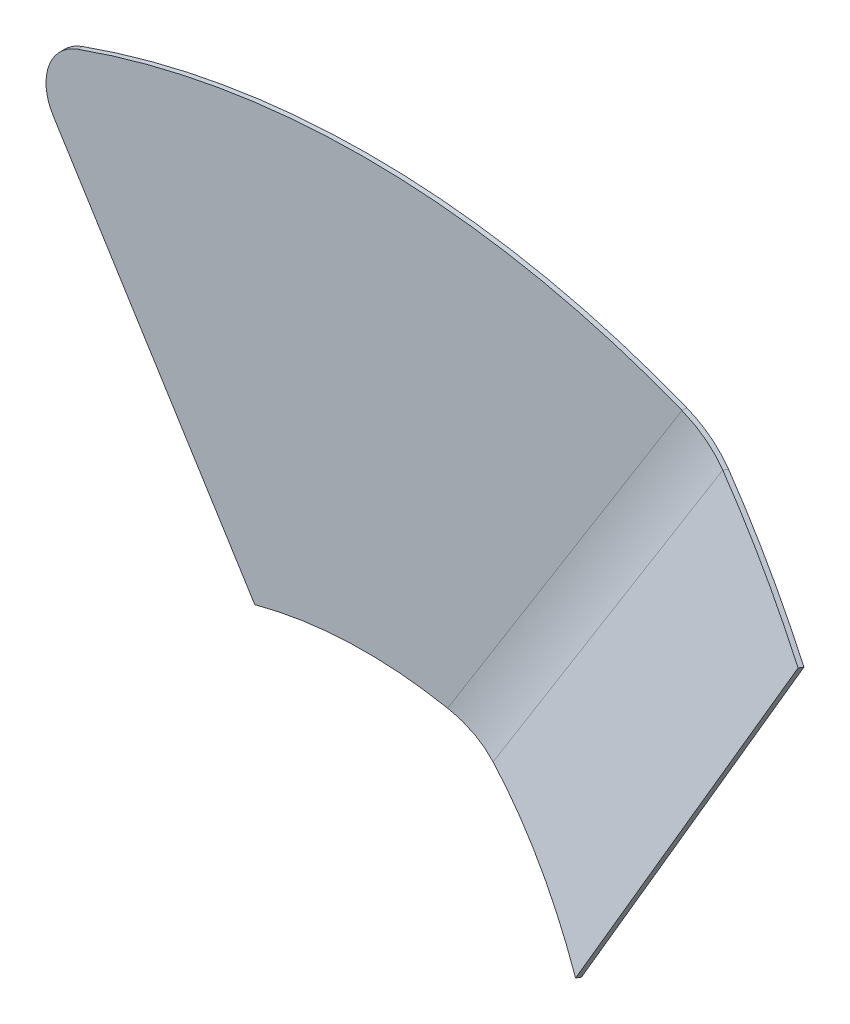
ISO-10303-21;
HEADER;
FILE_DESCRIPTION(('STEP AP214'),'2;1');
FILE_NAME('part.step','',(''),(''),'','','');
FILE_SCHEMA(('AUTOMOTIVE_DESIGN { 1 0 10303 214 1 1 1 1 }'));
ENDSEC;
DATA;
#1=APPLICATION_CONTEXT('core data for automotive mechanical design processes');
#2=APPLICATION_PROTOCOL_DEFINITION('international standard','automotive_design',2000,#1);
#3=PRODUCT_CONTEXT('',#1,'mechanical');
#4=PRODUCT('Part','Part','',(#3));
#5=PRODUCT_RELATED_PRODUCT_CATEGORY('part','',(#4));
#6=PRODUCT_DEFINITION_FORMATION('','',#4);
#7=PRODUCT_DEFINITION_CONTEXT('part definition',#1,'design');
#8=PRODUCT_DEFINITION('design','',#6,#7);
#9=PRODUCT_DEFINITION_SHAPE('','',#8);
#10=(LENGTH_UNIT() NAMED_UNIT(*) SI_UNIT(.MILLI.,.METRE.));
#11=(NAMED_UNIT(*) PLANE_ANGLE_UNIT() SI_UNIT($,.RADIAN.));
#12=(NAMED_UNIT(*) SI_UNIT($,.STERADIAN.) SOLID_ANGLE_UNIT());
#13=UNCERTAINTY_MEASURE_WITH_UNIT(LENGTH_MEASURE(1.E-05),#10,'distance_accuracy_value','');
#14=(GEOMETRIC_REPRESENTATION_CONTEXT(3) GLOBAL_UNCERTAINTY_ASSIGNED_CONTEXT((#13)) GLOBAL_UNIT_ASSIGNED_CONTEXT((#10,
#11,#12)) REPRESENTATION_CONTEXT('',''));
#15=CARTESIAN_POINT('',(0.,0.,0.));
#16=DIRECTION('',(0.,0.,1.));
#17=DIRECTION('',(1.,0.,0.));
#18=AXIS2_PLACEMENT_3D('',#15,#16,#17);
#19=CARTESIAN_POINT('',(-0.416680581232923,0.260370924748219,2.99307608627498));
#20=DIRECTION('',(-0.290049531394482,0.181243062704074,0.939692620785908));
#21=DIRECTION('',(0.956627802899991,0.027101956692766,0.290049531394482));
#22=AXIS2_PLACEMENT_3D('',#19,#20,#21);
#23=PLANE('',#22);
#24=CARTESIAN_POINT('',(-0.416680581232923,0.260370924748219,2.99307608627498));
#25=DIRECTION('',(-0.290049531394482,0.181243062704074,0.939692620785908));
#26=DIRECTION('',(0.956627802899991,0.027101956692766,0.290049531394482));
#27=AXIS2_PLACEMENT_3D('',#24,#25,#26);
#28=CIRCLE('',#27,54.);
#29=CARTESIAN_POINT('',(31.4014001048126,43.867948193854,4.40337611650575));
#30=VERTEX_POINT('',#29);
#31=CARTESIAN_POINT('',(23.1454572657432,48.8037283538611,0.903073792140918));
#32=VERTEX_POINT('',#31);
#33=EDGE_CURVE('E242',#30,#32,#28,.T.);
#34=ORIENTED_EDGE('',*,*,#33,.T.);
#35=DIRECTION('',(-0.529919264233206,-0.848048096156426,0.));
#36=VECTOR('',#35,1.);
#37=CARTESIAN_POINT('',(-5.28637128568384,3.30329139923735,0.903073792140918));
#38=LINE('',#37,#36);
#39=CARTESIAN_POINT('',(8.65018940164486,25.6064506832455,0.903073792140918));
#40=VERTEX_POINT('',#39);
#41=EDGE_CURVE('E38',#32,#40,#38,.T.);
#42=ORIENTED_EDGE('',*,*,#41,.T.);
#43=CARTESIAN_POINT('',(-0.416680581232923,0.260370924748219,2.99307608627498));
#44=DIRECTION('',(-0.290049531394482,0.181243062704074,0.939692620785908));
#45=DIRECTION('',(0.956627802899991,0.027101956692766,0.290049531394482));
#46=AXIS2_PLACEMENT_3D('',#43,#44,#45);
#47=CIRCLE('',#46,27.);
#48=CARTESIAN_POINT('',(17.6822308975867,20.2206679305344,4.72972421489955));
#49=VERTEX_POINT('',#48);
#50=EDGE_CURVE('E216',#49,#40,#47,.T.);
#51=ORIENTED_EDGE('',*,*,#50,.F.);
#52=DIRECTION('',(0.501784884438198,0.864910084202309,-0.0119363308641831));
#53=VECTOR('',#52,1.);
#54=CARTESIAN_POINT('',(17.6822308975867,20.2206679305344,4.72972421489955));
#55=LINE('',#54,#53);
#56=EDGE_CURVE('E246',#49,#30,#55,.T.);
#57=ORIENTED_EDGE('',*,*,#56,.T.);
#58=EDGE_LOOP('',(#34,#42,#51,#57));
#59=FACE_BOUND('',#58,.T.);
#60=ADVANCED_FACE('F28',(#59),#23,.T.);
#61=CARTESIAN_POINT('',(-0.416680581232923,0.260370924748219,2.99307608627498));
#62=DIRECTION('',(0.290049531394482,-0.181243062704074,-0.939692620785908));
#63=DIRECTION('',(-0.956627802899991,-0.027101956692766,-0.290049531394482));
#64=AXIS2_PLACEMENT_3D('',#61,#62,#63);
#65=CYLINDRICAL_SURFACE('',#64,27.);
#66=ORIENTED_EDGE('',*,*,#50,.T.);
#67=CARTESIAN_POINT('',(8.7372042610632,25.5520777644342,0.621166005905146));
#68=CARTESIAN_POINT('',(8.65018940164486,25.6064506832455,0.903073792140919));
#69=B_SPLINE_CURVE_WITH_KNOTS('',1,(#67,#68),.UNSPECIFIED.,.F.,.F.,(2,2),(0.,1.),.UNSPECIFIED.);
#70=CARTESIAN_POINT('',(8.73720426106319,25.5520777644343,0.621166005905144));
#71=VERTEX_POINT('',#70);
#72=EDGE_CURVE('E228',#40,#71,#69,.F.);
#73=ORIENTED_EDGE('',*,*,#72,.T.);
#74=CARTESIAN_POINT('',(-0.329665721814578,0.205998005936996,2.71116830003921));
#75=DIRECTION('',(-0.290049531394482,0.181243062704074,0.939692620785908));
#76=DIRECTION('',(0.956627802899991,0.027101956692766,0.290049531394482));
#77=AXIS2_PLACEMENT_3D('',#74,#75,#76);
#78=CIRCLE('',#77,27.);
#79=CARTESIAN_POINT('',(17.769245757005,20.1662950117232,4.44781642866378));
#80=VERTEX_POINT('',#79);
#81=EDGE_CURVE('E140',#80,#71,#78,.T.);
#82=ORIENTED_EDGE('',*,*,#81,.F.);
#83=DIRECTION('',(0.290049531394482,-0.181243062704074,-0.939692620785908));
#84=VECTOR('',#83,1.);
#85=CARTESIAN_POINT('',(17.6822308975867,20.2206679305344,4.72972421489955));
#86=LINE('',#85,#84);
#87=EDGE_CURVE('E52',#49,#80,#86,.T.);
#88=ORIENTED_EDGE('',*,*,#87,.F.);
#89=EDGE_LOOP('',(#66,#73,#82,#88));
#90=FACE_BOUND('',#89,.T.);
#91=ADVANCED_FACE('F30',(#90),#65,.F.);
#92=CARTESIAN_POINT('',(17.6822308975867,20.2206679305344,4.72972421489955));
#93=DIRECTION('',(-0.814913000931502,0.468061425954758,-0.34181179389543));
#94=DIRECTION('',(-0.501784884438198,-0.864910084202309,0.0119363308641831));
#95=AXIS2_PLACEMENT_3D('',#92,#93,#94);
#96=PLANE('',#95);
#97=DIRECTION('',(0.501784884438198,0.864910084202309,-0.0119363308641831));
#98=VECTOR('',#97,1.);
#99=CARTESIAN_POINT('',(17.769245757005,20.1662950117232,4.44781642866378));
#100=LINE('',#99,#98);
#101=CARTESIAN_POINT('',(31.4884149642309,43.8135752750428,4.12146833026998));
#102=VERTEX_POINT('',#101);
#103=EDGE_CURVE('E213',#80,#102,#100,.T.);
#104=ORIENTED_EDGE('',*,*,#103,.T.);
#105=DIRECTION('',(0.290049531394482,-0.181243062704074,-0.939692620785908));
#106=VECTOR('',#105,1.);
#107=CARTESIAN_POINT('',(31.4014001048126,43.867948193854,4.40337611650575));
#108=LINE('',#107,#106);
#109=EDGE_CURVE('E249',#30,#102,#108,.T.);
#110=ORIENTED_EDGE('',*,*,#109,.F.);
#111=ORIENTED_EDGE('',*,*,#56,.F.);
#112=ORIENTED_EDGE('',*,*,#87,.T.);
#113=EDGE_LOOP('',(#104,#110,#111,#112));
#114=FACE_BOUND('',#113,.T.);
#115=ADVANCED_FACE('F195',(#114),#96,.F.);
#116=CARTESIAN_POINT('',(-0.416680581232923,0.260370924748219,2.99307608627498));
#117=DIRECTION('',(0.290049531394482,-0.181243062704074,-0.939692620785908));
#118=DIRECTION('',(-0.956627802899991,-0.027101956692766,-0.290049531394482));
#119=AXIS2_PLACEMENT_3D('',#116,#117,#118);
#120=CYLINDRICAL_SURFACE('',#119,54.);
#121=CARTESIAN_POINT('',(23.1454572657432,48.8037283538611,0.903073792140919));
#122=CARTESIAN_POINT('',(23.2324721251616,48.7493554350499,0.621166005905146));
#123=B_SPLINE_CURVE_WITH_KNOTS('',1,(#121,#122),.UNSPECIFIED.,.F.,.F.,(2,2),(0.,1.),.UNSPECIFIED.);
#124=CARTESIAN_POINT('',(23.2324721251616,48.7493554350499,0.621166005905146));
#125=VERTEX_POINT('',#124);
#126=EDGE_CURVE('E238',#32,#125,#123,.T.);
#127=ORIENTED_EDGE('',*,*,#126,.F.);
#128=ORIENTED_EDGE('',*,*,#33,.F.);
#129=ORIENTED_EDGE('',*,*,#109,.T.);
#130=CARTESIAN_POINT('',(-0.329665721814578,0.205998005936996,2.71116830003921));
#131=DIRECTION('',(-0.290049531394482,0.181243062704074,0.939692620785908));
#132=DIRECTION('',(0.956627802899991,0.027101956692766,0.290049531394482));
#133=AXIS2_PLACEMENT_3D('',#130,#131,#132);
#134=CIRCLE('',#133,54.);
#135=EDGE_CURVE('E206',#102,#125,#134,.T.);
#136=ORIENTED_EDGE('',*,*,#135,.T.);
#137=EDGE_LOOP('',(#127,#128,#129,#136));
#138=FACE_BOUND('',#137,.T.);
#139=ADVANCED_FACE('F190',(#138),#120,.T.);
#140=CARTESIAN_POINT('',(-0.329665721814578,0.205998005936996,2.71116830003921));
#141=DIRECTION('',(-0.290049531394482,0.181243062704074,0.939692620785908));
#142=DIRECTION('',(0.956627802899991,0.027101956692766,0.290049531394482));
#143=AXIS2_PLACEMENT_3D('',#140,#141,#142);
#144=PLANE('',#143);
#145=DIRECTION('',(-0.529919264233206,-0.848048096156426,0.));
#146=VECTOR('',#145,1.);
#147=CARTESIAN_POINT('',(-5.1993564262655,3.24891848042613,0.621166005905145));
#148=LINE('',#147,#146);
#149=EDGE_CURVE('E11',#125,#71,#148,.T.);
#150=ORIENTED_EDGE('',*,*,#149,.F.);
#151=ORIENTED_EDGE('',*,*,#135,.F.);
#152=ORIENTED_EDGE('',*,*,#103,.F.);
#153=ORIENTED_EDGE('',*,*,#81,.T.);
#154=EDGE_LOOP('',(#150,#151,#152,#153));
#155=FACE_BOUND('',#154,.T.);
#156=ADVANCED_FACE('F187',(#155),#144,.F.);
#157=CARTESIAN_POINT('',(0.,0.,0.3));
#158=DIRECTION('',(0.,0.,-1.));
#159=DIRECTION('',(-1.,0.,0.));
#160=AXIS2_PLACEMENT_3D('',#157,#158,#159);
#161=CYLINDRICAL_SURFACE('',#160,54.);
#162=CARTESIAN_POINT('',(0.,0.,0.3));
#163=DIRECTION('',(0.,0.,1.));
#164=DIRECTION('',(1.,0.,0.));
#165=AXIS2_PLACEMENT_3D('',#162,#163,#164);
#166=CIRCLE('',#165,54.);
#167=CARTESIAN_POINT('',(19.9677823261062,50.17257885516,0.3));
#168=VERTEX_POINT('',#167);
#169=CARTESIAN_POINT('',(-18.1850655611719,50.8458787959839,0.3));
#170=VERTEX_POINT('',#169);
#171=EDGE_CURVE('E136',#168,#170,#166,.T.);
#172=ORIENTED_EDGE('',*,*,#171,.F.);
#173=CARTESIAN_POINT('',(19.9677823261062,50.1725788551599,0.));
#174=CARTESIAN_POINT('',(19.9677823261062,50.1725788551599,0.3));
#175=B_SPLINE_CURVE_WITH_KNOTS('',1,(#173,#174),.UNSPECIFIED.,.F.,.F.,(2,2),(0.,1.),.UNSPECIFIED.);
#176=CARTESIAN_POINT('',(19.9677823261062,50.1725788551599,0.));
#177=VERTEX_POINT('',#176);
#178=EDGE_CURVE('E102',#168,#177,#175,.F.);
#179=ORIENTED_EDGE('',*,*,#178,.T.);
#180=CARTESIAN_POINT('',(0.,0.,0.));
#181=DIRECTION('',(0.,0.,1.));
#182=DIRECTION('',(1.,0.,0.));
#183=AXIS2_PLACEMENT_3D('',#180,#181,#182);
#184=CIRCLE('',#183,54.);
#185=CARTESIAN_POINT('',(-18.1850655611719,50.8458787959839,0.));
#186=VERTEX_POINT('',#185);
#187=EDGE_CURVE('E160',#177,#186,#184,.T.);
#188=ORIENTED_EDGE('',*,*,#187,.T.);
#189=DIRECTION('',(0.,0.,-1.));
#190=VECTOR('',#189,1.);
#191=CARTESIAN_POINT('',(-18.1850655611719,50.8458787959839,0.3));
#192=LINE('',#191,#190);
#193=EDGE_CURVE('E144',#170,#186,#192,.T.);
#194=ORIENTED_EDGE('',*,*,#193,.F.);
#195=EDGE_LOOP('',(#172,#179,#188,#194));
#196=FACE_BOUND('',#195,.T.);
#197=ADVANCED_FACE('F142',(#196),#161,.T.);
#198=CARTESIAN_POINT('',(0.,0.,0.));
#199=DIRECTION('',(0.,0.,1.));
#200=DIRECTION('',(1.,0.,0.));
#201=AXIS2_PLACEMENT_3D('',#198,#199,#200);
#202=PLANE('',#201);
#203=ORIENTED_EDGE('',*,*,#187,.F.);
#204=DIRECTION('',(-0.529919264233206,-0.848048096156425,0.));
#205=VECTOR('',#204,1.);
#206=CARTESIAN_POINT('',(-8.18686659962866,5.1157220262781,0.));
#207=LINE('',#206,#205);
#208=CARTESIAN_POINT('',(5.17513568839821,26.499395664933,0.));
#209=VERTEX_POINT('',#208);
#210=EDGE_CURVE('E117',#177,#209,#207,.T.);
#211=ORIENTED_EDGE('',*,*,#210,.T.);
#212=CARTESIAN_POINT('',(0.,0.,0.));
#213=DIRECTION('',(0.,0.,1.));
#214=DIRECTION('',(1.,0.,0.));
#215=AXIS2_PLACEMENT_3D('',#212,#213,#214);
#216=CIRCLE('',#215,27.);
#217=CARTESIAN_POINT('',(-7.,26.0768096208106,0.));
#218=VERTEX_POINT('',#217);
#219=EDGE_CURVE('E171',#209,#218,#216,.T.);
#220=ORIENTED_EDGE('',*,*,#219,.T.);
#221=DIRECTION('',(-0.529919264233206,0.848048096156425,0.));
#222=VECTOR('',#221,1.);
#223=CARTESIAN_POINT('',(-7.,26.0768096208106,0.));
#224=LINE('',#223,#222);
#225=CARTESIAN_POINT('',(-19.718928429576,46.4313499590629,0.));
#226=VERTEX_POINT('',#225);
#227=EDGE_CURVE('E438',#218,#226,#224,.T.);
#228=ORIENTED_EDGE('',*,*,#227,.T.);
#229=CARTESIAN_POINT('',(-17.1747841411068,48.0211077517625,0.));
#230=DIRECTION('',(0.,0.,-1.));
#231=DIRECTION('',(-1.,0.,0.));
#232=AXIS2_PLACEMENT_3D('',#229,#230,#231);
#233=CIRCLE('',#232,3.00000000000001);
#234=EDGE_CURVE('E439',#226,#186,#233,.T.);
#235=ORIENTED_EDGE('',*,*,#234,.T.);
#236=EDGE_LOOP('',(#203,#211,#220,#228,#235));
#237=FACE_BOUND('',#236,.T.);
#238=ADVANCED_FACE('F184',(#237),#202,.F.);
#239=CARTESIAN_POINT('',(0.,0.,0.3));
#240=DIRECTION('',(0.,0.,-1.));
#241=DIRECTION('',(-1.,0.,0.));
#242=AXIS2_PLACEMENT_3D('',#239,#240,#241);
#243=CYLINDRICAL_SURFACE('',#242,27.);
#244=CARTESIAN_POINT('',(5.17513568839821,26.499395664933,0.3));
#245=CARTESIAN_POINT('',(5.17513568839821,26.499395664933,0.));
#246=B_SPLINE_CURVE_WITH_KNOTS('',1,(#244,#245),.UNSPECIFIED.,.F.,.F.,(2,2),(0.,1.),.UNSPECIFIED.);
#247=CARTESIAN_POINT('',(5.17513568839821,26.499395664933,0.3));
#248=VERTEX_POINT('',#247);
#249=EDGE_CURVE('E116',#248,#209,#246,.T.);
#250=ORIENTED_EDGE('',*,*,#249,.F.);
#251=CARTESIAN_POINT('',(0.,0.,0.3));
#252=DIRECTION('',(0.,0.,1.));
#253=DIRECTION('',(1.,0.,0.));
#254=AXIS2_PLACEMENT_3D('',#251,#252,#253);
#255=CIRCLE('',#254,27.);
#256=CARTESIAN_POINT('',(-7.,26.0768096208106,0.3));
#257=VERTEX_POINT('',#256);
#258=EDGE_CURVE('E139',#248,#257,#255,.T.);
#259=ORIENTED_EDGE('',*,*,#258,.T.);
#260=DIRECTION('',(0.,0.,-1.));
#261=VECTOR('',#260,1.);
#262=CARTESIAN_POINT('',(-7.,26.0768096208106,0.3));
#263=LINE('',#262,#261);
#264=EDGE_CURVE('E146',#257,#218,#263,.T.);
#265=ORIENTED_EDGE('',*,*,#264,.T.);
#266=ORIENTED_EDGE('',*,*,#219,.F.);
#267=EDGE_LOOP('',(#250,#259,#265,#266));
#268=FACE_BOUND('',#267,.T.);
#269=ADVANCED_FACE('F173',(#268),#243,.F.);
#270=CARTESIAN_POINT('',(-17.1747841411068,48.0211077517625,0.3));
#271=DIRECTION('',(0.,0.,-1.));
#272=DIRECTION('',(-1.,0.,0.));
#273=AXIS2_PLACEMENT_3D('',#270,#271,#272);
#274=CYLINDRICAL_SURFACE('',#273,3.00000000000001);
#275=ORIENTED_EDGE('',*,*,#234,.F.);
#276=DIRECTION('',(0.,0.,-1.));
#277=VECTOR('',#276,1.);
#278=CARTESIAN_POINT('',(-19.718928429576,46.4313499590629,0.3));
#279=LINE('',#278,#277);
#280=CARTESIAN_POINT('',(-19.718928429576,46.4313499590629,0.3));
#281=VERTEX_POINT('',#280);
#282=EDGE_CURVE('E150',#281,#226,#279,.T.);
#283=ORIENTED_EDGE('',*,*,#282,.F.);
#284=CARTESIAN_POINT('',(-17.1747841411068,48.0211077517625,0.3));
#285=DIRECTION('',(0.,0.,-1.));
#286=DIRECTION('',(-1.,0.,0.));
#287=AXIS2_PLACEMENT_3D('',#284,#285,#286);
#288=CIRCLE('',#287,3.00000000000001);
#289=EDGE_CURVE('E147',#281,#170,#288,.T.);
#290=ORIENTED_EDGE('',*,*,#289,.T.);
#291=ORIENTED_EDGE('',*,*,#193,.T.);
#292=EDGE_LOOP('',(#275,#283,#290,#291));
#293=FACE_BOUND('',#292,.T.);
#294=ADVANCED_FACE('F183',(#293),#274,.T.);
#295=CARTESIAN_POINT('',(-7.,26.0768096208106,0.3));
#296=DIRECTION('',(-0.848048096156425,-0.529919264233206,0.));
#297=DIRECTION('',(0.529919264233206,-0.848048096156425,0.));
#298=AXIS2_PLACEMENT_3D('',#295,#296,#297);
#299=PLANE('',#298);
#300=ORIENTED_EDGE('',*,*,#227,.F.);
#301=ORIENTED_EDGE('',*,*,#264,.F.);
#302=DIRECTION('',(-0.529919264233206,0.848048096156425,0.));
#303=VECTOR('',#302,1.);
#304=CARTESIAN_POINT('',(-7.,26.0768096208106,0.3));
#305=LINE('',#304,#303);
#306=EDGE_CURVE('E152',#257,#281,#305,.T.);
#307=ORIENTED_EDGE('',*,*,#306,.T.);
#308=ORIENTED_EDGE('',*,*,#282,.T.);
#309=EDGE_LOOP('',(#300,#301,#307,#308));
#310=FACE_BOUND('',#309,.T.);
#311=ADVANCED_FACE('F185',(#310),#299,.T.);
#312=CARTESIAN_POINT('',(0.,0.,0.3));
#313=DIRECTION('',(0.,0.,1.));
#314=DIRECTION('',(1.,0.,0.));
#315=AXIS2_PLACEMENT_3D('',#312,#313,#314);
#316=PLANE('',#315);
#317=DIRECTION('',(-0.529919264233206,-0.848048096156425,0.));
#318=VECTOR('',#317,1.);
#319=CARTESIAN_POINT('',(-8.18686659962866,5.1157220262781,0.3));
#320=LINE('',#319,#318);
#321=EDGE_CURVE('E125',#168,#248,#320,.T.);
#322=ORIENTED_EDGE('',*,*,#321,.F.);
#323=ORIENTED_EDGE('',*,*,#171,.T.);
#324=ORIENTED_EDGE('',*,*,#289,.F.);
#325=ORIENTED_EDGE('',*,*,#306,.F.);
#326=ORIENTED_EDGE('',*,*,#258,.F.);
#327=EDGE_LOOP('',(#322,#323,#324,#325,#326));
#328=FACE_BOUND('',#327,.T.);
#329=ADVANCED_FACE('F134',(#328),#316,.T.);
#330=CARTESIAN_POINT('',(8.7372042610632,25.5520777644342,0.621166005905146));
#331=CARTESIAN_POINT('',(8.57159298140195,25.6059165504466,0.559663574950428));
#332=CARTESIAN_POINT('',(8.41690503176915,25.655619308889,0.507312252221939));
#333=CARTESIAN_POINT('',(8.20228516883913,25.7233207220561,0.439738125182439));
#334=CARTESIAN_POINT('',(8.13364459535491,25.7447477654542,0.419043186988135));
#335=CARTESIAN_POINT('',(8.03513257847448,25.775115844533,0.39043642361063));
#336=CARTESIAN_POINT('',(8.00303651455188,25.7849432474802,0.381307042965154));
#337=CARTESIAN_POINT('',(7.95601511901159,25.799234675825,0.36818611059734));
#338=CARTESIAN_POINT('',(7.94052842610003,25.8039235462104,0.363908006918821));
#339=CARTESIAN_POINT('',(7.91758029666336,25.8108436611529,0.357629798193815));
#340=CARTESIAN_POINT('',(7.90997790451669,25.8131315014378,0.355560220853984));
#341=CARTESIAN_POINT('',(7.89864494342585,25.8165348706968,0.352490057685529));
#342=CARTESIAN_POINT('',(7.89487906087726,25.8176645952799,0.351472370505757));
#343=CARTESIAN_POINT('',(7.88737086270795,25.8199145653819,0.349448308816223));
#344=CARTESIAN_POINT('',(7.88448466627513,25.8207788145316,0.348671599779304));
#345=CARTESIAN_POINT('',(7.58635311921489,25.9099259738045,0.268693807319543));
#346=CARTESIAN_POINT('',(7.29089415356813,25.9938082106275,0.204189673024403));
#347=CARTESIAN_POINT('',(6.84805511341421,26.112301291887,0.127727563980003));
#348=CARTESIAN_POINT('',(6.6988474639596,26.1510192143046,0.105328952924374));
#349=CARTESIAN_POINT('',(6.47280966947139,26.2078229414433,0.0764715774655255));
#350=CARTESIAN_POINT('',(6.39709275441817,26.2265452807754,0.0676424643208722));
#351=CARTESIAN_POINT('',(6.28298223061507,26.2542971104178,0.0555965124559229));
#352=CARTESIAN_POINT('',(6.24485620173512,26.2634924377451,0.0517808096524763));
#353=CARTESIAN_POINT('',(6.18753608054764,26.2772008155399,0.0463582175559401));
#354=CARTESIAN_POINT('',(6.16840752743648,26.2817561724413,0.0446008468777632));
#355=CARTESIAN_POINT('',(6.13968226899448,26.2885678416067,0.0420402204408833));
#356=CARTESIAN_POINT('',(6.13010177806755,26.2908348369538,0.0411992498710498));
#357=CARTESIAN_POINT('',(6.11572297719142,26.2942299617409,0.0399566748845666));
#358=CARTESIAN_POINT('',(6.11092869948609,26.295360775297,0.0395456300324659));
#359=CARTESIAN_POINT('',(6.10133746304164,26.2976206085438,0.0387298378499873));
#360=CARTESIAN_POINT('',(6.09565811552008,26.2989570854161,0.0382512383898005));
#361=CARTESIAN_POINT('',(5.84112416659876,26.3588002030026,0.0169478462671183));
#362=CARTESIAN_POINT('',(5.53549705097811,26.4253880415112,0.));
#363=CARTESIAN_POINT('',(5.17513568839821,26.499395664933,0.));
#364=CARTESIAN_POINT('',(8.65018940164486,25.6064506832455,0.903073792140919));
#365=CARTESIAN_POINT('',(8.48875193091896,25.6576813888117,0.843362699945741));
#366=CARTESIAN_POINT('',(8.33795480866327,25.7049528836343,0.792536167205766));
#367=CARTESIAN_POINT('',(8.12871678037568,25.7692913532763,0.726930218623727));
#368=CARTESIAN_POINT('',(8.06179449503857,25.7896446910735,0.706838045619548));
#369=CARTESIAN_POINT('',(7.96574351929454,25.8184749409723,0.679064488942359));
#370=CARTESIAN_POINT('',(7.93444840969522,25.8278018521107,0.670201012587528));
#371=CARTESIAN_POINT('',(7.88859904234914,25.8413609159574,0.657462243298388));
#372=CARTESIAN_POINT('',(7.87349812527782,25.8458087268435,0.65330874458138));
#373=CARTESIAN_POINT('',(7.85112127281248,25.8523718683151,0.647213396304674));
#374=CARTESIAN_POINT('',(7.84370807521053,25.8545414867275,0.645204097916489));
#375=CARTESIAN_POINT('',(7.83265705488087,25.8577686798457,0.642223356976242));
#376=CARTESIAN_POINT('',(7.82898484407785,25.8588398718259,0.641235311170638));
#377=CARTESIAN_POINT('',(7.82166337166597,25.8609731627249,0.639270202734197));
#378=CARTESIAN_POINT('',(7.81884894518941,25.8617925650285,0.638516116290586));
#379=CARTESIAN_POINT('',(7.5281292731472,25.9463082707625,0.560867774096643));
#380=CARTESIAN_POINT('',(7.23995728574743,26.025637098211,0.498242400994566));
#381=CARTESIAN_POINT('',(6.80794544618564,26.1373645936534,0.424007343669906));
#382=CARTESIAN_POINT('',(6.66237006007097,26.1738128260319,0.402261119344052));
#383=CARTESIAN_POINT('',(6.44181063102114,26.2271932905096,0.37424424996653));
#384=CARTESIAN_POINT('',(6.36792483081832,26.2447714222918,0.365672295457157));
#385=CARTESIAN_POINT('',(6.25656784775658,26.2708026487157,0.353977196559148));
#386=CARTESIAN_POINT('',(6.21936081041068,26.2794237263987,0.350272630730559));
#387=CARTESIAN_POINT('',(6.16342081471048,26.2922697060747,0.345007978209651));
#388=CARTESIAN_POINT('',(6.14475257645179,26.2965374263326,0.343301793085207));
#389=CARTESIAN_POINT('',(6.116718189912,26.3029173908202,0.340815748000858));
#390=CARTESIAN_POINT('',(6.10736805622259,26.3050404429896,0.339999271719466));
#391=CARTESIAN_POINT('',(6.09333488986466,26.3082195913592,0.338792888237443));
#392=CARTESIAN_POINT('',(6.08865584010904,26.3092784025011,0.338393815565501));
#393=CARTESIAN_POINT('',(6.07929509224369,26.3113942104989,0.337601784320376));
#394=CARTESIAN_POINT('',(6.07375220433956,26.3126454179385,0.337137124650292));
#395=CARTESIAN_POINT('',(5.82533331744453,26.3686674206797,0.316454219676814));
#396=CARTESIAN_POINT('',(5.52697938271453,26.4307102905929,0.3));
#397=CARTESIAN_POINT('',(5.17513568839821,26.499395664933,0.3));
#398=B_SPLINE_SURFACE_WITH_KNOTS('',1,3,((#330,#331,#332,#333,#334,#335,#336,#337,#338,#339,
#340,#341,#342,#343,#344,#345,#346,#347,#348,#349,#350,#351,#352,#353,#354,#355,#356,#357,#358,
#359,#360,#361,#362,#363),(#364,#365,#366,#367,#368,#369,#370,#371,#372,#373,#374,#375,#376,
#377,#378,#379,#380,#381,#382,#383,#384,#385,#386,#387,#388,#389,#390,#391,#392,#393,#394,#395,
#396,#397)),.UNSPECIFIED.,.F.,.F.,.F.,(2,2),(4,2,2,2,2,2,2,2,2,2,2,2,2,2,2,2,4),(0.,1.),(0.,
0.125,0.1875,0.21875,0.234375,0.2421875,0.24609375,0.25,0.5,0.625,0.6875,0.71875,0.734375,
0.7421875,0.74609375,0.75,1.),.UNSPECIFIED.);
#399=CARTESIAN_POINT('',(8.65018940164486,25.6064506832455,0.903073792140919));
#400=CARTESIAN_POINT('',(8.48875193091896,25.6576813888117,0.843362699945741));
#401=CARTESIAN_POINT('',(8.33795480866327,25.7049528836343,0.792536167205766));
#402=CARTESIAN_POINT('',(8.12871678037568,25.7692913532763,0.726930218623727));
#403=CARTESIAN_POINT('',(8.06179449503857,25.7896446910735,0.706838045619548));
#404=CARTESIAN_POINT('',(7.96574351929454,25.8184749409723,0.679064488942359));
#405=CARTESIAN_POINT('',(7.93444840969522,25.8278018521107,0.670201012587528));
#406=CARTESIAN_POINT('',(7.88859904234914,25.8413609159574,0.657462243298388));
#407=CARTESIAN_POINT('',(7.87349812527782,25.8458087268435,0.65330874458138));
#408=CARTESIAN_POINT('',(7.85112127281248,25.8523718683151,0.647213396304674));
#409=CARTESIAN_POINT('',(7.84370807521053,25.8545414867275,0.645204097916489));
#410=CARTESIAN_POINT('',(7.83265705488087,25.8577686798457,0.642223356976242));
#411=CARTESIAN_POINT('',(7.82898484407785,25.8588398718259,0.641235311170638));
#412=CARTESIAN_POINT('',(7.82166337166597,25.8609731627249,0.639270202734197));
#413=CARTESIAN_POINT('',(7.81884894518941,25.8617925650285,0.638516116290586));
#414=CARTESIAN_POINT('',(7.5281292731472,25.9463082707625,0.560867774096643));
#415=CARTESIAN_POINT('',(7.23995728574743,26.025637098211,0.498242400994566));
#416=CARTESIAN_POINT('',(6.80794544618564,26.1373645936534,0.424007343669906));
#417=CARTESIAN_POINT('',(6.66237006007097,26.1738128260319,0.402261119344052));
#418=CARTESIAN_POINT('',(6.44181063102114,26.2271932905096,0.37424424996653));
#419=CARTESIAN_POINT('',(6.36792483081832,26.2447714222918,0.365672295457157));
#420=CARTESIAN_POINT('',(6.25656784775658,26.2708026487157,0.353977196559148));
#421=CARTESIAN_POINT('',(6.21936081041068,26.2794237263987,0.350272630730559));
#422=CARTESIAN_POINT('',(6.16342081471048,26.2922697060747,0.345007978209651));
#423=CARTESIAN_POINT('',(6.14475257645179,26.2965374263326,0.343301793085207));
#424=CARTESIAN_POINT('',(6.116718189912,26.3029173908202,0.340815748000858));
#425=CARTESIAN_POINT('',(6.10736805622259,26.3050404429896,0.339999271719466));
#426=CARTESIAN_POINT('',(6.09333488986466,26.3082195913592,0.338792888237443));
#427=CARTESIAN_POINT('',(6.08865584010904,26.3092784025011,0.338393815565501));
#428=CARTESIAN_POINT('',(6.07929509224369,26.3113942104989,0.337601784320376));
#429=CARTESIAN_POINT('',(6.07375220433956,26.3126454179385,0.337137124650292));
#430=CARTESIAN_POINT('',(5.82533331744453,26.3686674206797,0.316454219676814));
#431=CARTESIAN_POINT('',(5.52697938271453,26.4307102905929,0.3));
#432=CARTESIAN_POINT('',(5.17513568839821,26.499395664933,0.3));
#433=B_SPLINE_CURVE_WITH_KNOTS('',3,(#399,#400,#401,#402,#403,#404,#405,#406,#407,#408,#409,
#410,#411,#412,#413,#414,#415,#416,#417,#418,#419,#420,#421,#422,#423,#424,#425,#426,#427,#428,
#429,#430,#431,#432),.UNSPECIFIED.,.F.,.F.,(4,2,2,2,2,2,2,2,2,2,2,2,2,2,2,2,4),(0.,0.125,0.1875,
0.21875,0.234375,0.2421875,0.24609375,0.25,0.5,0.625,0.6875,0.71875,0.734375,0.7421875,
0.74609375,0.75,1.),.UNSPECIFIED.);
#434=EDGE_CURVE('E129',#40,#248,#433,.T.);
#435=CARTESIAN_POINT('',(5.17513568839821,26.499395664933,0.));
#436=CARTESIAN_POINT('',(5.53549705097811,26.4253880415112,0.));
#437=CARTESIAN_POINT('',(5.84112416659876,26.3588002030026,0.0169478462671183));
#438=CARTESIAN_POINT('',(6.09565811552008,26.2989570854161,0.0382512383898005));
#439=CARTESIAN_POINT('',(6.10133746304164,26.2976206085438,0.0387298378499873));
#440=CARTESIAN_POINT('',(6.11092869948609,26.295360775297,0.0395456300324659));
#441=CARTESIAN_POINT('',(6.11572297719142,26.2942299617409,0.0399566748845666));
#442=CARTESIAN_POINT('',(6.13010177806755,26.2908348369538,0.0411992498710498));
#443=CARTESIAN_POINT('',(6.13968226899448,26.2885678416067,0.0420402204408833));
#444=CARTESIAN_POINT('',(6.16840752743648,26.2817561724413,0.0446008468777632));
#445=CARTESIAN_POINT('',(6.18753608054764,26.2772008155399,0.0463582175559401));
#446=CARTESIAN_POINT('',(6.24485620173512,26.2634924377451,0.0517808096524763));
#447=CARTESIAN_POINT('',(6.28298223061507,26.2542971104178,0.0555965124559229));
#448=CARTESIAN_POINT('',(6.39709275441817,26.2265452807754,0.0676424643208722));
#449=CARTESIAN_POINT('',(6.47280966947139,26.2078229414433,0.0764715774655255));
#450=CARTESIAN_POINT('',(6.6988474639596,26.1510192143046,0.105328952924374));
#451=CARTESIAN_POINT('',(6.84805511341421,26.112301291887,0.127727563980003));
#452=CARTESIAN_POINT('',(7.29089415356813,25.9938082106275,0.204189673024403));
#453=CARTESIAN_POINT('',(7.58635311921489,25.9099259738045,0.268693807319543));
#454=CARTESIAN_POINT('',(7.88448466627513,25.8207788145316,0.348671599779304));
#455=CARTESIAN_POINT('',(7.88737086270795,25.8199145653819,0.349448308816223));
#456=CARTESIAN_POINT('',(7.89487906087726,25.8176645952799,0.351472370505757));
#457=CARTESIAN_POINT('',(7.89864494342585,25.8165348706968,0.352490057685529));
#458=CARTESIAN_POINT('',(7.90997790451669,25.8131315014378,0.355560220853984));
#459=CARTESIAN_POINT('',(7.91758029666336,25.8108436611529,0.357629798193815));
#460=CARTESIAN_POINT('',(7.94052842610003,25.8039235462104,0.363908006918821));
#461=CARTESIAN_POINT('',(7.95601511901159,25.799234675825,0.36818611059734));
#462=CARTESIAN_POINT('',(8.00303651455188,25.7849432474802,0.381307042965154));
#463=CARTESIAN_POINT('',(8.03513257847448,25.775115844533,0.39043642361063));
#464=CARTESIAN_POINT('',(8.13364459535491,25.7447477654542,0.419043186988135));
#465=CARTESIAN_POINT('',(8.20228516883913,25.7233207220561,0.439738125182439));
#466=CARTESIAN_POINT('',(8.41690503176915,25.655619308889,0.507312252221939));
#467=CARTESIAN_POINT('',(8.57159298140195,25.6059165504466,0.559663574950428));
#468=CARTESIAN_POINT('',(8.7372042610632,25.5520777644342,0.621166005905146));
#469=B_SPLINE_CURVE_WITH_KNOTS('',3,(#435,#436,#437,#438,#439,#440,#441,#442,#443,#444,#445,
#446,#447,#448,#449,#450,#451,#452,#453,#454,#455,#456,#457,#458,#459,#460,#461,#462,#463,#464,
#465,#466,#467,#468),.UNSPECIFIED.,.F.,.F.,(4,2,2,2,2,2,2,2,2,2,2,2,2,2,2,2,4),(0.,0.25,
0.25390625,0.2578125,0.265625,0.28125,0.3125,0.375,0.5,0.75,0.75390625,0.7578125,0.765625,
0.78125,0.8125,0.875,1.),.UNSPECIFIED.);
#470=EDGE_CURVE('E261',#71,#209,#469,.F.);
#471=ORIENTED_EDGE('',*,*,#72,.F.);
#472=ORIENTED_EDGE('',*,*,#434,.T.);
#473=ORIENTED_EDGE('',*,*,#249,.T.);
#474=ORIENTED_EDGE('',*,*,#470,.F.);
#475=EDGE_LOOP('',(#471,#472,#473,#474));
#476=FACE_BOUND('',#475,.T.);
#477=ADVANCED_FACE('F314',(#476),#398,.T.);
#478=CARTESIAN_POINT('',(23.2324721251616,48.7493554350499,0.621166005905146));
#479=CARTESIAN_POINT('',(23.0666578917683,48.8265992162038,0.555086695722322));
#480=CARTESIAN_POINT('',(22.9175303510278,48.895929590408,0.50139790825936));
#481=CARTESIAN_POINT('',(22.7203946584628,48.9870959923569,0.434965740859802));
#482=CARTESIAN_POINT('',(22.6591031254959,49.0153504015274,0.415182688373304));
#483=CARTESIAN_POINT('',(22.5739323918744,49.054445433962,0.388585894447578));
#484=CARTESIAN_POINT('',(22.5466695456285,49.0669295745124,0.380233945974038));
#485=CARTESIAN_POINT('',(22.5074803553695,49.0848257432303,0.368424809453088));
#486=CARTESIAN_POINT('',(22.4947014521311,49.0906528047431,0.364608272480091));
#487=CARTESIAN_POINT('',(22.475960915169,49.0991849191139,0.359057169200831));
#488=CARTESIAN_POINT('',(22.4697853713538,49.1019942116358,0.357235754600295));
#489=CARTESIAN_POINT('',(22.4606291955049,49.1061559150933,0.354546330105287));
#490=CARTESIAN_POINT('',(22.4575949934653,49.1075344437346,0.353656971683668));
#491=CARTESIAN_POINT('',(22.4530704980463,49.1095891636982,0.352333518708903));
#492=CARTESIAN_POINT('',(22.4515668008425,49.1102718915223,0.351894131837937));
#493=CARTESIAN_POINT('',(22.4485683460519,49.1116329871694,0.351018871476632));
#494=CARTESIAN_POINT('',(22.4476252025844,49.1120610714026,0.350743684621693));
#495=CARTESIAN_POINT('',(22.3149016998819,49.1722816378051,0.312080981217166));
#496=CARTESIAN_POINT('',(22.1819606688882,49.2320290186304,0.27670509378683));
#497=CARTESIAN_POINT('',(21.97927770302,49.3222564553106,0.227991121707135));
#498=CARTESIAN_POINT('',(21.9111716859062,49.3524331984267,0.212478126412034));
#499=CARTESIAN_POINT('',(21.8082117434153,49.397839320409,0.190335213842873));
#500=CARTESIAN_POINT('',(21.77375828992,49.4129981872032,0.183142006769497));
#501=CARTESIAN_POINT('',(21.7218801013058,49.4357703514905,0.172638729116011));
#502=CARTESIAN_POINT('',(21.7045543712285,49.4433667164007,0.169185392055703));
#503=CARTESIAN_POINT('',(21.6785165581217,49.4547695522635,0.164077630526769));
#504=CARTESIAN_POINT('',(21.6698290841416,49.4585718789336,0.162387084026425));
#505=CARTESIAN_POINT('',(21.6524377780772,49.4661792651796,0.159030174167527));
#506=CARTESIAN_POINT('',(21.6430979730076,49.4702621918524,0.157243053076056));
#507=CARTESIAN_POINT('',(21.1181570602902,49.6996175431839,0.0575679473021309));
#508=CARTESIAN_POINT('',(20.5604225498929,49.9338249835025,0.));
#509=CARTESIAN_POINT('',(19.9677823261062,50.1725788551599,0.));
#510=CARTESIAN_POINT('',(23.1454572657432,48.8037283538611,0.903073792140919));
#511=CARTESIAN_POINT('',(22.9841274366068,48.8781699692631,0.83891912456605));
#512=CARTESIAN_POINT('',(22.8390311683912,48.9449813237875,0.786794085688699));
#513=CARTESIAN_POINT('',(22.647218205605,49.0328217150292,0.722296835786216));
#514=CARTESIAN_POINT('',(22.5875803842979,49.0600427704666,0.703089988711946));
#515=CARTESIAN_POINT('',(22.504705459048,49.0977032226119,0.677267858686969));
#516=CARTESIAN_POINT('',(22.4781770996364,49.1097284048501,0.66915917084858));
#517=CARTESIAN_POINT('',(22.4400430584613,49.1269652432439,0.657693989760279));
#518=CARTESIAN_POINT('',(22.4276081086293,49.1325773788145,0.653988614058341));
#519=CARTESIAN_POINT('',(22.409371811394,49.140794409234,0.648599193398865));
#520=CARTESIAN_POINT('',(22.4033623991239,49.143499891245,0.646830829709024));
#521=CARTESIAN_POINT('',(22.394452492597,49.1475077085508,0.644219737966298));
#522=CARTESIAN_POINT('',(22.3914998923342,49.1488352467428,0.643356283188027));
#523=CARTESIAN_POINT('',(22.387097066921,49.1508139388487,0.642071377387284));
#524=CARTESIAN_POINT('',(22.3856338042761,49.1514714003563,0.641644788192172));
#525=CARTESIAN_POINT('',(22.3827159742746,49.1527821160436,0.640795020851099));
#526=CARTESIAN_POINT('',(22.3817981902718,49.1531943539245,0.640527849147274));
#527=CARTESIAN_POINT('',(22.2526431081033,49.2111851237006,0.602991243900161));
#528=CARTESIAN_POINT('',(22.1232688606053,49.2687037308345,0.568645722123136));
#529=CARTESIAN_POINT('',(21.9260125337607,49.355540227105,0.52135060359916));
#530=CARTESIAN_POINT('',(21.8597281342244,49.384578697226,0.50628944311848));
#531=CARTESIAN_POINT('',(21.7595192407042,49.4282657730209,0.484791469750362));
#532=CARTESIAN_POINT('',(21.7259859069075,49.4428496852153,0.477807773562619));
#533=CARTESIAN_POINT('',(21.6754924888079,49.4647565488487,0.467610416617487));
#534=CARTESIAN_POINT('',(21.6586291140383,49.4720640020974,0.464257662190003));
#535=CARTESIAN_POINT('',(21.6332859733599,49.4830327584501,0.459298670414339));
#536=CARTESIAN_POINT('',(21.6248302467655,49.4866902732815,0.457657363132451));
#537=CARTESIAN_POINT('',(21.6079028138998,49.4940077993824,0.454398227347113));
#538=CARTESIAN_POINT('',(21.5988120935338,49.4979350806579,0.452663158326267));
#539=CARTESIAN_POINT('',(21.0878692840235,49.7185434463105,0.355891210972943));
#540=CARTESIAN_POINT('',(20.5448830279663,49.9435350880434,0.299999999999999));
#541=CARTESIAN_POINT('',(19.9677823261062,50.1725788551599,0.3));
#542=B_SPLINE_SURFACE_WITH_KNOTS('',1,3,((#478,#479,#480,#481,#482,#483,#484,#485,#486,#487,
#488,#489,#490,#491,#492,#493,#494,#495,#496,#497,#498,#499,#500,#501,#502,#503,#504,#505,#506,
#507,#508,#509),(#510,#511,#512,#513,#514,#515,#516,#517,#518,#519,#520,#521,#522,#523,#524,
#525,#526,#527,#528,#529,#530,#531,#532,#533,#534,#535,#536,#537,#538,#539,#540,#541)),
.UNSPECIFIED.,.F.,.F.,.F.,(2,2),(4,2,2,2,2,2,2,2,2,2,2,2,2,2,2,4),(0.,1.),(0.,0.125,0.1875,
0.21875,0.234375,0.2421875,0.24609375,0.248046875,0.25,0.375,0.4375,0.46875,0.484375,0.4921875,
0.5,1.),.UNSPECIFIED.);
#543=CARTESIAN_POINT('',(19.9677823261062,50.1725788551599,0.3));
#544=CARTESIAN_POINT('',(20.5448830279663,49.9435350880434,0.299999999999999));
#545=CARTESIAN_POINT('',(21.0878692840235,49.7185434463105,0.355891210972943));
#546=CARTESIAN_POINT('',(21.5988120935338,49.4979350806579,0.452663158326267));
#547=CARTESIAN_POINT('',(21.6079028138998,49.4940077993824,0.454398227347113));
#548=CARTESIAN_POINT('',(21.6248302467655,49.4866902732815,0.457657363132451));
#549=CARTESIAN_POINT('',(21.6332859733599,49.4830327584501,0.459298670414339));
#550=CARTESIAN_POINT('',(21.6586291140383,49.4720640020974,0.464257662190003));
#551=CARTESIAN_POINT('',(21.6754924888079,49.4647565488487,0.467610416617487));
#552=CARTESIAN_POINT('',(21.7259859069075,49.4428496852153,0.477807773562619));
#553=CARTESIAN_POINT('',(21.7595192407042,49.4282657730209,0.484791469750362));
#554=CARTESIAN_POINT('',(21.8597281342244,49.384578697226,0.50628944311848));
#555=CARTESIAN_POINT('',(21.9260125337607,49.355540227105,0.52135060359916));
#556=CARTESIAN_POINT('',(22.1232688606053,49.2687037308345,0.568645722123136));
#557=CARTESIAN_POINT('',(22.2526431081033,49.2111851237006,0.602991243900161));
#558=CARTESIAN_POINT('',(22.3817981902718,49.1531943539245,0.640527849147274));
#559=CARTESIAN_POINT('',(22.3827159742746,49.1527821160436,0.640795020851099));
#560=CARTESIAN_POINT('',(22.3856338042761,49.1514714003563,0.641644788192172));
#561=CARTESIAN_POINT('',(22.387097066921,49.1508139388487,0.642071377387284));
#562=CARTESIAN_POINT('',(22.3914998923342,49.1488352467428,0.643356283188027));
#563=CARTESIAN_POINT('',(22.394452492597,49.1475077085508,0.644219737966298));
#564=CARTESIAN_POINT('',(22.4033623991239,49.143499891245,0.646830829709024));
#565=CARTESIAN_POINT('',(22.409371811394,49.140794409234,0.648599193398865));
#566=CARTESIAN_POINT('',(22.4276081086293,49.1325773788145,0.653988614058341));
#567=CARTESIAN_POINT('',(22.4400430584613,49.1269652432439,0.657693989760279));
#568=CARTESIAN_POINT('',(22.4781770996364,49.1097284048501,0.66915917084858));
#569=CARTESIAN_POINT('',(22.504705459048,49.0977032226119,0.677267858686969));
#570=CARTESIAN_POINT('',(22.5875803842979,49.0600427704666,0.703089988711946));
#571=CARTESIAN_POINT('',(22.647218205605,49.0328217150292,0.722296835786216));
#572=CARTESIAN_POINT('',(22.8390311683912,48.9449813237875,0.786794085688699));
#573=CARTESIAN_POINT('',(22.9841274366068,48.8781699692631,0.83891912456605));
#574=CARTESIAN_POINT('',(23.1454572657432,48.8037283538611,0.903073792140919));
#575=B_SPLINE_CURVE_WITH_KNOTS('',3,(#543,#544,#545,#546,#547,#548,#549,#550,#551,#552,#553,
#554,#555,#556,#557,#558,#559,#560,#561,#562,#563,#564,#565,#566,#567,#568,#569,#570,#571,#572,
#573,#574),.UNSPECIFIED.,.F.,.F.,(4,2,2,2,2,2,2,2,2,2,2,2,2,2,2,4),(0.,0.5,0.5078125,0.515625,
0.53125,0.5625,0.625,0.75,0.751953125,0.75390625,0.7578125,0.765625,0.78125,0.8125,0.875,1.),.UNSPECIFIED.);
#576=EDGE_CURVE('E106',#32,#168,#575,.F.);
#577=CARTESIAN_POINT('',(23.2324721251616,48.7493554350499,0.621166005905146));
#578=CARTESIAN_POINT('',(23.0666578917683,48.8265992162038,0.555086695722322));
#579=CARTESIAN_POINT('',(22.9175303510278,48.895929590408,0.50139790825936));
#580=CARTESIAN_POINT('',(22.7203946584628,48.9870959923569,0.434965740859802));
#581=CARTESIAN_POINT('',(22.6591031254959,49.0153504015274,0.415182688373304));
#582=CARTESIAN_POINT('',(22.5739323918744,49.054445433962,0.388585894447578));
#583=CARTESIAN_POINT('',(22.5466695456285,49.0669295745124,0.380233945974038));
#584=CARTESIAN_POINT('',(22.5074803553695,49.0848257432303,0.368424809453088));
#585=CARTESIAN_POINT('',(22.4947014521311,49.0906528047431,0.364608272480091));
#586=CARTESIAN_POINT('',(22.475960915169,49.0991849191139,0.359057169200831));
#587=CARTESIAN_POINT('',(22.4697853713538,49.1019942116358,0.357235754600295));
#588=CARTESIAN_POINT('',(22.4606291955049,49.1061559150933,0.354546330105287));
#589=CARTESIAN_POINT('',(22.4575949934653,49.1075344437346,0.353656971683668));
#590=CARTESIAN_POINT('',(22.4530704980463,49.1095891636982,0.352333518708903));
#591=CARTESIAN_POINT('',(22.4515668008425,49.1102718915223,0.351894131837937));
#592=CARTESIAN_POINT('',(22.4485683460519,49.1116329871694,0.351018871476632));
#593=CARTESIAN_POINT('',(22.4476252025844,49.1120610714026,0.350743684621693));
#594=CARTESIAN_POINT('',(22.3149016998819,49.1722816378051,0.312080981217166));
#595=CARTESIAN_POINT('',(22.1819606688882,49.2320290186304,0.27670509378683));
#596=CARTESIAN_POINT('',(21.97927770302,49.3222564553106,0.227991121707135));
#597=CARTESIAN_POINT('',(21.9111716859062,49.3524331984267,0.212478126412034));
#598=CARTESIAN_POINT('',(21.8082117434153,49.397839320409,0.190335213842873));
#599=CARTESIAN_POINT('',(21.77375828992,49.4129981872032,0.183142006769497));
#600=CARTESIAN_POINT('',(21.7218801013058,49.4357703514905,0.172638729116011));
#601=CARTESIAN_POINT('',(21.7045543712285,49.4433667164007,0.169185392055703));
#602=CARTESIAN_POINT('',(21.6785165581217,49.4547695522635,0.164077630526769));
#603=CARTESIAN_POINT('',(21.6698290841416,49.4585718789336,0.162387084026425));
#604=CARTESIAN_POINT('',(21.6524377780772,49.4661792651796,0.159030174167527));
#605=CARTESIAN_POINT('',(21.6430979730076,49.4702621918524,0.157243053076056));
#606=CARTESIAN_POINT('',(21.1181570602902,49.6996175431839,0.0575679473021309));
#607=CARTESIAN_POINT('',(20.5604225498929,49.9338249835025,0.));
#608=CARTESIAN_POINT('',(19.9677823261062,50.1725788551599,0.));
#609=B_SPLINE_CURVE_WITH_KNOTS('',3,(#577,#578,#579,#580,#581,#582,#583,#584,#585,#586,#587,
#588,#589,#590,#591,#592,#593,#594,#595,#596,#597,#598,#599,#600,#601,#602,#603,#604,#605,#606,
#607,#608),.UNSPECIFIED.,.F.,.F.,(4,2,2,2,2,2,2,2,2,2,2,2,2,2,2,4),(0.,0.125,0.1875,0.21875,
0.234375,0.2421875,0.24609375,0.248046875,0.25,0.375,0.4375,0.46875,0.484375,0.4921875,0.5,1.),.UNSPECIFIED.);
#610=EDGE_CURVE('E109',#125,#177,#609,.T.);
#611=ORIENTED_EDGE('',*,*,#178,.F.);
#612=ORIENTED_EDGE('',*,*,#576,.F.);
#613=ORIENTED_EDGE('',*,*,#126,.T.);
#614=ORIENTED_EDGE('',*,*,#610,.T.);
#615=EDGE_LOOP('',(#611,#612,#613,#614));
#616=FACE_BOUND('',#615,.T.);
#617=ADVANCED_FACE('F105',(#616),#542,.F.);
#618=CARTESIAN_POINT('',(-28.7028933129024,-27.7167839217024,10.3));
#619=DIRECTION('',(0.529919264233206,0.848048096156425,0.));
#620=DIRECTION('',(-0.848048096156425,0.529919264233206,0.));
#621=AXIS2_PLACEMENT_3D('',#618,#619,#620);
#622=CYLINDRICAL_SURFACE('',#621,10.3);
#623=ORIENTED_EDGE('',*,*,#610,.F.);
#624=ORIENTED_EDGE('',*,*,#149,.T.);
#625=ORIENTED_EDGE('',*,*,#470,.T.);
#626=ORIENTED_EDGE('',*,*,#210,.F.);
#627=EDGE_LOOP('',(#623,#624,#625,#626));
#628=FACE_BOUND('',#627,.T.);
#629=ADVANCED_FACE('F259',(#628),#622,.T.);
#630=CARTESIAN_POINT('',(-28.7028933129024,-27.7167839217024,10.3));
#631=DIRECTION('',(0.529919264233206,0.848048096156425,0.));
#632=DIRECTION('',(-0.848048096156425,0.529919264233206,0.));
#633=AXIS2_PLACEMENT_3D('',#630,#631,#632);
#634=CYLINDRICAL_SURFACE('',#633,10.);
#635=ORIENTED_EDGE('',*,*,#576,.T.);
#636=ORIENTED_EDGE('',*,*,#321,.T.);
#637=ORIENTED_EDGE('',*,*,#434,.F.);
#638=ORIENTED_EDGE('',*,*,#41,.F.);
#639=EDGE_LOOP('',(#635,#636,#637,#638));
#640=FACE_BOUND('',#639,.T.);
#641=ADVANCED_FACE('F123',(#640),#634,.F.);
#642=CLOSED_SHELL('',(#60,#91,#115,#139,#156,#197,#238,#269,#294,#311,#329,#477,#617,#629,#641));
#643=MANIFOLD_SOLID_BREP('B2',#642);
#644=ADVANCED_BREP_SHAPE_REPRESENTATION('',(#18,#643),#14);
#645=SHAPE_DEFINITION_REPRESENTATION(#9,#644);
ENDSEC;
END-ISO-10303-21;
